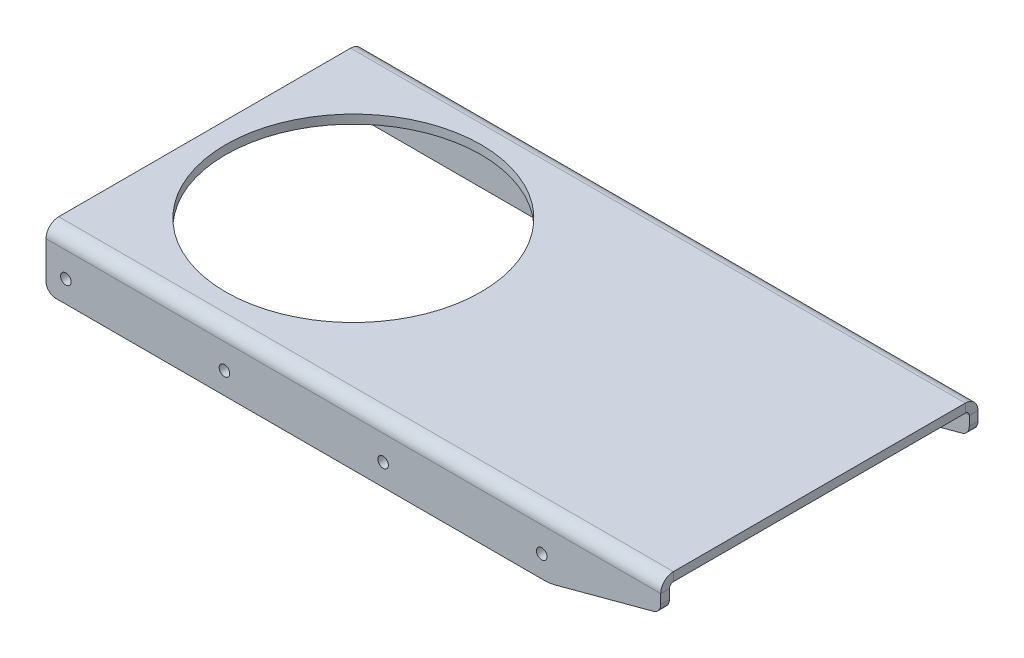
ISO-10303-21;
HEADER;
FILE_DESCRIPTION(('STEP AP214'),'2;1');
FILE_NAME('part.step','',(''),(''),'','','');
FILE_SCHEMA(('AUTOMOTIVE_DESIGN { 1 0 10303 214 1 1 1 1 }'));
ENDSEC;
DATA;
#1=APPLICATION_CONTEXT('core data for automotive mechanical design processes');
#2=APPLICATION_PROTOCOL_DEFINITION('international standard','automotive_design',2000,#1);
#3=PRODUCT_CONTEXT('',#1,'mechanical');
#4=PRODUCT('Part','Part','',(#3));
#5=PRODUCT_RELATED_PRODUCT_CATEGORY('part','',(#4));
#6=PRODUCT_DEFINITION_FORMATION('','',#4);
#7=PRODUCT_DEFINITION_CONTEXT('part definition',#1,'design');
#8=PRODUCT_DEFINITION('design','',#6,#7);
#9=PRODUCT_DEFINITION_SHAPE('','',#8);
#10=(LENGTH_UNIT() NAMED_UNIT(*) SI_UNIT(.MILLI.,.METRE.));
#11=(NAMED_UNIT(*) PLANE_ANGLE_UNIT() SI_UNIT($,.RADIAN.));
#12=(NAMED_UNIT(*) SI_UNIT($,.STERADIAN.) SOLID_ANGLE_UNIT());
#13=UNCERTAINTY_MEASURE_WITH_UNIT(LENGTH_MEASURE(1.E-05),#10,'distance_accuracy_value','');
#14=(GEOMETRIC_REPRESENTATION_CONTEXT(3) GLOBAL_UNCERTAINTY_ASSIGNED_CONTEXT((#13)) GLOBAL_UNIT_ASSIGNED_CONTEXT((#10,
#11,#12)) REPRESENTATION_CONTEXT('',''));
#15=CARTESIAN_POINT('',(0.,0.,0.));
#16=DIRECTION('',(0.,0.,1.));
#17=DIRECTION('',(1.,0.,0.));
#18=AXIS2_PLACEMENT_3D('',#15,#16,#17);
#19=CARTESIAN_POINT('',(0.,-5.588,0.));
#20=DIRECTION('',(0.,1.,0.));
#21=DIRECTION('',(0.,0.,1.));
#22=AXIS2_PLACEMENT_3D('',#19,#20,#21);
#23=PLANE('',#22);
#24=CARTESIAN_POINT('',(95.25,-5.588,0.));
#25=DIRECTION('',(0.,1.,0.));
#26=DIRECTION('',(0.,0.,1.));
#27=AXIS2_PLACEMENT_3D('',#24,#25,#26);
#28=CIRCLE('',#27,81.75625);
#29=CARTESIAN_POINT('',(95.25,-5.588,81.75625));
#30=VERTEX_POINT('',#29);
#31=EDGE_CURVE('E340',#30,#30,#28,.T.);
#32=ORIENTED_EDGE('',*,*,#31,.T.);
#33=EDGE_LOOP('',(#32));
#34=FACE_BOUND('',#33,.T.);
#35=DIRECTION('',(1.,0.,0.));
#36=VECTOR('',#35,1.);
#37=CARTESIAN_POINT('',(393.7,-5.58799999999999,-93.472));
#38=LINE('',#37,#36);
#39=CARTESIAN_POINT('',(393.7,-5.58799999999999,-93.472));
#40=VERTEX_POINT('',#39);
#41=CARTESIAN_POINT('',(0.,-5.58799999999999,-93.472));
#42=VERTEX_POINT('',#41);
#43=EDGE_CURVE('E283',#40,#42,#38,.F.);
#44=ORIENTED_EDGE('',*,*,#43,.F.);
#45=DIRECTION('',(0.,0.,-1.));
#46=VECTOR('',#45,1.);
#47=CARTESIAN_POINT('',(393.7,-5.588,-101.6));
#48=LINE('',#47,#46);
#49=CARTESIAN_POINT('',(393.7,-5.58799999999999,93.472));
#50=VERTEX_POINT('',#49);
#51=EDGE_CURVE('E349',#50,#40,#48,.T.);
#52=ORIENTED_EDGE('',*,*,#51,.F.);
#53=DIRECTION('',(-1.,0.,0.));
#54=VECTOR('',#53,1.);
#55=CARTESIAN_POINT('',(0.,-5.58799999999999,93.472));
#56=LINE('',#55,#54);
#57=CARTESIAN_POINT('',(0.,-5.58799999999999,93.472));
#58=VERTEX_POINT('',#57);
#59=EDGE_CURVE('E330',#58,#50,#56,.F.);
#60=ORIENTED_EDGE('',*,*,#59,.F.);
#61=DIRECTION('',(0.,0.,1.));
#62=VECTOR('',#61,1.);
#63=CARTESIAN_POINT('',(0.,-5.588,-101.6));
#64=LINE('',#63,#62);
#65=EDGE_CURVE('E346',#42,#58,#64,.T.);
#66=ORIENTED_EDGE('',*,*,#65,.F.);
#67=EDGE_LOOP('',(#44,#52,#60,#66));
#68=FACE_BOUND('',#67,.T.);
#69=ADVANCED_FACE('F89',(#34,#68),#23,.F.);
#70=CARTESIAN_POINT('',(0.,0.,0.));
#71=DIRECTION('',(0.,1.,0.));
#72=DIRECTION('',(0.,0.,1.));
#73=AXIS2_PLACEMENT_3D('',#70,#71,#72);
#74=PLANE('',#73);
#75=CARTESIAN_POINT('',(95.25,0.,0.));
#76=DIRECTION('',(0.,1.,0.));
#77=DIRECTION('',(0.,0.,1.));
#78=AXIS2_PLACEMENT_3D('',#75,#76,#77);
#79=CIRCLE('',#78,81.75625);
#80=CARTESIAN_POINT('',(95.25,0.,81.75625));
#81=VERTEX_POINT('',#80);
#82=EDGE_CURVE('E337',#81,#81,#79,.T.);
#83=ORIENTED_EDGE('',*,*,#82,.F.);
#84=EDGE_LOOP('',(#83));
#85=FACE_BOUND('',#84,.T.);
#86=DIRECTION('',(0.,0.,-1.));
#87=VECTOR('',#86,1.);
#88=CARTESIAN_POINT('',(393.7,0.,-101.6));
#89=LINE('',#88,#87);
#90=CARTESIAN_POINT('',(393.7,0.,93.472));
#91=VERTEX_POINT('',#90);
#92=CARTESIAN_POINT('',(393.7,0.,-93.472));
#93=VERTEX_POINT('',#92);
#94=EDGE_CURVE('E350',#91,#93,#89,.T.);
#95=ORIENTED_EDGE('',*,*,#94,.T.);
#96=DIRECTION('',(1.,0.,0.));
#97=VECTOR('',#96,1.);
#98=CARTESIAN_POINT('',(393.7,0.,-93.472));
#99=LINE('',#98,#97);
#100=CARTESIAN_POINT('',(0.,0.,-93.472));
#101=VERTEX_POINT('',#100);
#102=EDGE_CURVE('E232',#93,#101,#99,.F.);
#103=ORIENTED_EDGE('',*,*,#102,.T.);
#104=DIRECTION('',(0.,0.,1.));
#105=VECTOR('',#104,1.);
#106=CARTESIAN_POINT('',(0.,0.,-101.6));
#107=LINE('',#106,#105);
#108=CARTESIAN_POINT('',(0.,0.,93.472));
#109=VERTEX_POINT('',#108);
#110=EDGE_CURVE('E343',#101,#109,#107,.T.);
#111=ORIENTED_EDGE('',*,*,#110,.T.);
#112=DIRECTION('',(-1.,0.,0.));
#113=VECTOR('',#112,1.);
#114=CARTESIAN_POINT('',(0.,0.,93.472));
#115=LINE('',#114,#113);
#116=EDGE_CURVE('E317',#109,#91,#115,.F.);
#117=ORIENTED_EDGE('',*,*,#116,.T.);
#118=EDGE_LOOP('',(#95,#103,#111,#117));
#119=FACE_BOUND('',#118,.T.);
#120=ADVANCED_FACE('F454',(#85,#119),#74,.T.);
#121=CARTESIAN_POINT('',(393.7,-5.588,-101.6));
#122=DIRECTION('',(1.,0.,0.));
#123=DIRECTION('',(0.,0.,-1.));
#124=AXIS2_PLACEMENT_3D('',#121,#122,#123);
#125=PLANE('',#124);
#126=ORIENTED_EDGE('',*,*,#51,.T.);
#127=DIRECTION('',(0.,1.,0.));
#128=VECTOR('',#127,1.);
#129=CARTESIAN_POINT('',(393.7,-5.58799999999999,-93.472));
#130=LINE('',#129,#128);
#131=EDGE_CURVE('E279',#40,#93,#130,.T.);
#132=ORIENTED_EDGE('',*,*,#131,.T.);
#133=ORIENTED_EDGE('',*,*,#94,.F.);
#134=DIRECTION('',(0.,1.,0.));
#135=VECTOR('',#134,1.);
#136=CARTESIAN_POINT('',(393.7,-5.58799999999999,93.472));
#137=LINE('',#136,#135);
#138=EDGE_CURVE('E334',#50,#91,#137,.T.);
#139=ORIENTED_EDGE('',*,*,#138,.F.);
#140=EDGE_LOOP('',(#126,#132,#133,#139));
#141=FACE_BOUND('',#140,.T.);
#142=ADVANCED_FACE('F461',(#141),#125,.T.);
#143=CARTESIAN_POINT('',(0.,-5.588,-101.6));
#144=DIRECTION('',(-1.,0.,0.));
#145=DIRECTION('',(0.,0.,1.));
#146=AXIS2_PLACEMENT_3D('',#143,#144,#145);
#147=PLANE('',#146);
#148=DIRECTION('',(0.,1.,0.));
#149=VECTOR('',#148,1.);
#150=CARTESIAN_POINT('',(0.,-5.58799999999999,-93.472));
#151=LINE('',#150,#149);
#152=EDGE_CURVE('E286',#42,#101,#151,.T.);
#153=ORIENTED_EDGE('',*,*,#152,.F.);
#154=ORIENTED_EDGE('',*,*,#65,.T.);
#155=DIRECTION('',(0.,1.,0.));
#156=VECTOR('',#155,1.);
#157=CARTESIAN_POINT('',(0.,-5.58799999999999,93.472));
#158=LINE('',#157,#156);
#159=EDGE_CURVE('E324',#58,#109,#158,.T.);
#160=ORIENTED_EDGE('',*,*,#159,.T.);
#161=ORIENTED_EDGE('',*,*,#110,.F.);
#162=EDGE_LOOP('',(#153,#154,#160,#161));
#163=FACE_BOUND('',#162,.T.);
#164=ADVANCED_FACE('F471',(#163),#147,.T.);
#165=CARTESIAN_POINT('',(95.25,-5.588,0.));
#166=DIRECTION('',(0.,1.,0.));
#167=DIRECTION('',(0.,0.,1.));
#168=AXIS2_PLACEMENT_3D('',#165,#166,#167);
#169=CYLINDRICAL_SURFACE('',#168,81.75625);
#170=ORIENTED_EDGE('',*,*,#31,.F.);
#171=EDGE_LOOP('',(#170));
#172=FACE_BOUND('',#171,.T.);
#173=ORIENTED_EDGE('',*,*,#82,.T.);
#174=EDGE_LOOP('',(#173));
#175=FACE_BOUND('',#174,.T.);
#176=ADVANCED_FACE('F466',(#172,#175),#169,.F.);
#177=CARTESIAN_POINT('',(393.7,-8.12799999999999,93.472));
#178=DIRECTION('',(1.,0.,0.));
#179=DIRECTION('',(0.,0.,-1.));
#180=AXIS2_PLACEMENT_3D('',#177,#178,#179);
#181=PLANE('',#180);
#182=DIRECTION('',(0.,0.,-1.));
#183=VECTOR('',#182,1.);
#184=CARTESIAN_POINT('',(393.7,-8.12799999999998,101.6));
#185=LINE('',#184,#183);
#186=CARTESIAN_POINT('',(393.7,-8.12799999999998,96.012));
#187=VERTEX_POINT('',#186);
#188=CARTESIAN_POINT('',(393.7,-8.12799999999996,101.6));
#189=VERTEX_POINT('',#188);
#190=EDGE_CURVE('E289',#187,#189,#185,.F.);
#191=ORIENTED_EDGE('',*,*,#190,.F.);
#192=CARTESIAN_POINT('',(393.7,-8.12799999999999,93.472));
#193=DIRECTION('',(-1.,0.,0.));
#194=DIRECTION('',(0.,0.,1.));
#195=AXIS2_PLACEMENT_3D('',#192,#193,#194);
#196=CIRCLE('',#195,2.54);
#197=EDGE_CURVE('E327',#50,#187,#196,.F.);
#198=ORIENTED_EDGE('',*,*,#197,.F.);
#199=ORIENTED_EDGE('',*,*,#138,.T.);
#200=CARTESIAN_POINT('',(393.7,-8.12799999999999,93.472));
#201=DIRECTION('',(-1.,0.,0.));
#202=DIRECTION('',(0.,0.,1.));
#203=AXIS2_PLACEMENT_3D('',#200,#201,#202);
#204=CIRCLE('',#203,8.128);
#205=EDGE_CURVE('E320',#91,#189,#204,.F.);
#206=ORIENTED_EDGE('',*,*,#205,.T.);
#207=EDGE_LOOP('',(#191,#198,#199,#206));
#208=FACE_BOUND('',#207,.T.);
#209=ADVANCED_FACE('F792',(#208),#181,.T.);
#210=CARTESIAN_POINT('',(0.,-8.12799999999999,93.472));
#211=DIRECTION('',(1.,0.,0.));
#212=DIRECTION('',(0.,0.,-1.));
#213=AXIS2_PLACEMENT_3D('',#210,#211,#212);
#214=PLANE('',#213);
#215=CARTESIAN_POINT('',(0.,-8.12799999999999,93.472));
#216=DIRECTION('',(-1.,0.,0.));
#217=DIRECTION('',(0.,0.,1.));
#218=AXIS2_PLACEMENT_3D('',#215,#216,#217);
#219=CIRCLE('',#218,2.54);
#220=CARTESIAN_POINT('',(0.,-8.12799999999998,96.012));
#221=VERTEX_POINT('',#220);
#222=EDGE_CURVE('E293',#221,#58,#219,.T.);
#223=ORIENTED_EDGE('',*,*,#222,.F.);
#224=DIRECTION('',(0.,0.,-1.));
#225=VECTOR('',#224,1.);
#226=CARTESIAN_POINT('',(0.,-8.128,96.012));
#227=LINE('',#226,#225);
#228=CARTESIAN_POINT('',(0.,-8.128,101.6));
#229=VERTEX_POINT('',#228);
#230=EDGE_CURVE('E310',#221,#229,#227,.F.);
#231=ORIENTED_EDGE('',*,*,#230,.T.);
#232=CARTESIAN_POINT('',(0.,-8.12799999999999,93.472));
#233=DIRECTION('',(-1.,0.,0.));
#234=DIRECTION('',(0.,0.,1.));
#235=AXIS2_PLACEMENT_3D('',#232,#233,#234);
#236=CIRCLE('',#235,8.128);
#237=EDGE_CURVE('E321',#229,#109,#236,.T.);
#238=ORIENTED_EDGE('',*,*,#237,.T.);
#239=ORIENTED_EDGE('',*,*,#159,.F.);
#240=EDGE_LOOP('',(#223,#231,#238,#239));
#241=FACE_BOUND('',#240,.T.);
#242=ADVANCED_FACE('F781',(#241),#214,.F.);
#243=CARTESIAN_POINT('',(0.,-8.12799999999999,93.472));
#244=DIRECTION('',(-1.,0.,0.));
#245=DIRECTION('',(0.,0.,1.));
#246=AXIS2_PLACEMENT_3D('',#243,#244,#245);
#247=CYLINDRICAL_SURFACE('',#246,8.128);
#248=ORIENTED_EDGE('',*,*,#116,.F.);
#249=ORIENTED_EDGE('',*,*,#237,.F.);
#250=DIRECTION('',(-1.,0.,0.));
#251=VECTOR('',#250,1.);
#252=CARTESIAN_POINT('',(393.7,-8.12799999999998,101.6));
#253=LINE('',#252,#251);
#254=EDGE_CURVE('E307',#229,#189,#253,.F.);
#255=ORIENTED_EDGE('',*,*,#254,.T.);
#256=ORIENTED_EDGE('',*,*,#205,.F.);
#257=EDGE_LOOP('',(#248,#249,#255,#256));
#258=FACE_BOUND('',#257,.T.);
#259=ADVANCED_FACE('F770',(#258),#247,.T.);
#260=CARTESIAN_POINT('',(0.,-8.12799999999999,93.472));
#261=DIRECTION('',(-1.,0.,0.));
#262=DIRECTION('',(0.,0.,1.));
#263=AXIS2_PLACEMENT_3D('',#260,#261,#262);
#264=CYLINDRICAL_SURFACE('',#263,2.54);
#265=ORIENTED_EDGE('',*,*,#59,.T.);
#266=ORIENTED_EDGE('',*,*,#197,.T.);
#267=DIRECTION('',(-1.,0.,0.));
#268=VECTOR('',#267,1.);
#269=CARTESIAN_POINT('',(393.7,-8.12799999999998,96.012));
#270=LINE('',#269,#268);
#271=EDGE_CURVE('E313',#187,#221,#270,.T.);
#272=ORIENTED_EDGE('',*,*,#271,.T.);
#273=ORIENTED_EDGE('',*,*,#222,.T.);
#274=EDGE_LOOP('',(#265,#266,#272,#273));
#275=FACE_BOUND('',#274,.T.);
#276=ADVANCED_FACE('F759',(#275),#264,.F.);
#277=CARTESIAN_POINT('',(0.,-38.1,101.6));
#278=DIRECTION('',(1.,0.,0.));
#279=DIRECTION('',(0.,1.,0.));
#280=AXIS2_PLACEMENT_3D('',#277,#278,#279);
#281=PLANE('',#280);
#282=DIRECTION('',(0.,1.,0.));
#283=VECTOR('',#282,1.);
#284=CARTESIAN_POINT('',(0.,-38.1,96.0120000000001));
#285=LINE('',#284,#283);
#286=CARTESIAN_POINT('',(0.,-31.75,96.0120000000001));
#287=VERTEX_POINT('',#286);
#288=EDGE_CURVE('E304',#221,#287,#285,.F.);
#289=ORIENTED_EDGE('',*,*,#288,.T.);
#290=DIRECTION('',(0.,0.,-1.));
#291=VECTOR('',#290,1.);
#292=CARTESIAN_POINT('',(0.,-31.75,101.6));
#293=LINE('',#292,#291);
#294=CARTESIAN_POINT('',(0.,-31.75,101.6));
#295=VERTEX_POINT('',#294);
#296=EDGE_CURVE('E415',#287,#295,#293,.F.);
#297=ORIENTED_EDGE('',*,*,#296,.T.);
#298=DIRECTION('',(0.,-1.,0.));
#299=VECTOR('',#298,1.);
#300=CARTESIAN_POINT('',(0.,3.66455092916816E-13,101.6));
#301=LINE('',#300,#299);
#302=EDGE_CURVE('E296',#229,#295,#301,.T.);
#303=ORIENTED_EDGE('',*,*,#302,.F.);
#304=ORIENTED_EDGE('',*,*,#230,.F.);
#305=EDGE_LOOP('',(#289,#297,#303,#304));
#306=FACE_BOUND('',#305,.T.);
#307=ADVANCED_FACE('F748',(#306),#281,.F.);
#308=CARTESIAN_POINT('',(393.7,-5.58799999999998,101.6));
#309=DIRECTION('',(-1.,0.,0.));
#310=DIRECTION('',(0.,0.,1.));
#311=AXIS2_PLACEMENT_3D('',#308,#309,#310);
#312=PLANE('',#311);
#313=DIRECTION('',(0.,1.,0.));
#314=VECTOR('',#313,1.);
#315=CARTESIAN_POINT('',(393.7,3.66455092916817E-13,101.6));
#316=LINE('',#315,#314);
#317=CARTESIAN_POINT('',(393.7,-14.1774736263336,101.6));
#318=VERTEX_POINT('',#317);
#319=EDGE_CURVE('E291',#318,#189,#316,.T.);
#320=ORIENTED_EDGE('',*,*,#319,.F.);
#321=DIRECTION('',(0.,0.,1.));
#322=VECTOR('',#321,1.);
#323=CARTESIAN_POINT('',(393.7,-14.1774736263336,96.012));
#324=LINE('',#323,#322);
#325=CARTESIAN_POINT('',(393.7,-14.1774736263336,96.012));
#326=VERTEX_POINT('',#325);
#327=EDGE_CURVE('E392',#318,#326,#324,.F.);
#328=ORIENTED_EDGE('',*,*,#327,.T.);
#329=DIRECTION('',(0.,-1.,0.));
#330=VECTOR('',#329,1.);
#331=CARTESIAN_POINT('',(393.7,-5.588,96.012));
#332=LINE('',#331,#330);
#333=EDGE_CURVE('E299',#326,#187,#332,.F.);
#334=ORIENTED_EDGE('',*,*,#333,.T.);
#335=ORIENTED_EDGE('',*,*,#190,.T.);
#336=EDGE_LOOP('',(#320,#328,#334,#335));
#337=FACE_BOUND('',#336,.T.);
#338=ADVANCED_FACE('F515',(#337),#312,.F.);
#339=CARTESIAN_POINT('',(0.,3.66455092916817E-13,101.6));
#340=DIRECTION('',(0.,0.,-1.));
#341=DIRECTION('',(0.,1.,0.));
#342=AXIS2_PLACEMENT_3D('',#339,#340,#341);
#343=PLANE('',#342);
#344=CARTESIAN_POINT('',(12.7,-24.13,101.6));
#345=DIRECTION('',(0.,0.,1.));
#346=DIRECTION('',(1.,0.,0.));
#347=AXIS2_PLACEMENT_3D('',#344,#345,#346);
#348=CIRCLE('',#347,3.3782);
#349=CARTESIAN_POINT('',(16.0782,-24.13,101.6));
#350=VERTEX_POINT('',#349);
#351=EDGE_CURVE('E902',#350,#350,#348,.T.);
#352=ORIENTED_EDGE('',*,*,#351,.F.);
#353=EDGE_LOOP('',(#352));
#354=FACE_BOUND('',#353,.T.);
#355=CARTESIAN_POINT('',(114.3,-24.13,101.6));
#356=DIRECTION('',(0.,0.,1.));
#357=DIRECTION('',(1.,0.,0.));
#358=AXIS2_PLACEMENT_3D('',#355,#356,#357);
#359=CIRCLE('',#358,3.3782);
#360=CARTESIAN_POINT('',(117.6782,-24.13,101.6));
#361=VERTEX_POINT('',#360);
#362=EDGE_CURVE('E890',#361,#361,#359,.T.);
#363=ORIENTED_EDGE('',*,*,#362,.F.);
#364=EDGE_LOOP('',(#363));
#365=FACE_BOUND('',#364,.T.);
#366=CARTESIAN_POINT('',(215.9,-24.13,101.6));
#367=DIRECTION('',(0.,0.,1.));
#368=DIRECTION('',(1.,0.,0.));
#369=AXIS2_PLACEMENT_3D('',#366,#367,#368);
#370=CIRCLE('',#369,3.3782);
#371=CARTESIAN_POINT('',(219.2782,-24.13,101.6));
#372=VERTEX_POINT('',#371);
#373=EDGE_CURVE('E883',#372,#372,#370,.T.);
#374=ORIENTED_EDGE('',*,*,#373,.F.);
#375=EDGE_LOOP('',(#374));
#376=FACE_BOUND('',#375,.T.);
#377=CARTESIAN_POINT('',(317.5,-24.13,101.6));
#378=DIRECTION('',(0.,0.,1.));
#379=DIRECTION('',(1.,0.,0.));
#380=AXIS2_PLACEMENT_3D('',#377,#378,#379);
#381=CIRCLE('',#380,3.3782);
#382=CARTESIAN_POINT('',(320.8782,-24.13,101.6));
#383=VERTEX_POINT('',#382);
#384=EDGE_CURVE('E876',#383,#383,#381,.T.);
#385=ORIENTED_EDGE('',*,*,#384,.F.);
#386=EDGE_LOOP('',(#385));
#387=FACE_BOUND('',#386,.T.);
#388=DIRECTION('',(1.,0.,0.));
#389=VECTOR('',#388,1.);
#390=CARTESIAN_POINT('',(0.,-38.1,101.6));
#391=LINE('',#390,#389);
#392=CARTESIAN_POINT('',(6.34999999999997,-38.1,101.6));
#393=VERTEX_POINT('',#392);
#394=CARTESIAN_POINT('',(319.260458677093,-38.1,101.6));
#395=VERTEX_POINT('',#394);
#396=EDGE_CURVE('E294',#393,#395,#391,.T.);
#397=ORIENTED_EDGE('',*,*,#396,.T.);
#398=CARTESIAN_POINT('',(319.260458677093,-12.7,101.6));
#399=DIRECTION('',(0.,0.,-1.));
#400=DIRECTION('',(0.,1.,0.));
#401=AXIS2_PLACEMENT_3D('',#398,#399,#400);
#402=CIRCLE('',#401,25.4);
#403=CARTESIAN_POINT('',(325.834462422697,-37.2345159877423,101.6));
#404=VERTEX_POINT('',#403);
#405=EDGE_CURVE('E111',#395,#404,#402,.F.);
#406=ORIENTED_EDGE('',*,*,#405,.T.);
#407=DIRECTION('',(-0.965925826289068,-0.258819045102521,0.));
#408=VECTOR('',#407,1.);
#409=CARTESIAN_POINT('',(393.7,-19.05,101.6));
#410=LINE('',#409,#408);
#411=CARTESIAN_POINT('',(388.993500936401,-20.3111026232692,101.6));
#412=VERTEX_POINT('',#411);
#413=EDGE_CURVE('E373',#404,#412,#410,.F.);
#414=ORIENTED_EDGE('',*,*,#413,.T.);
#415=CARTESIAN_POINT('',(387.35,-14.1774736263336,101.6));
#416=DIRECTION('',(0.,0.,-1.));
#417=DIRECTION('',(0.,1.,0.));
#418=AXIS2_PLACEMENT_3D('',#415,#416,#417);
#419=CIRCLE('',#418,6.35);
#420=EDGE_CURVE('E404',#412,#318,#419,.F.);
#421=ORIENTED_EDGE('',*,*,#420,.T.);
#422=ORIENTED_EDGE('',*,*,#319,.T.);
#423=ORIENTED_EDGE('',*,*,#254,.F.);
#424=ORIENTED_EDGE('',*,*,#302,.T.);
#425=CARTESIAN_POINT('',(6.34999999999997,-31.75,101.6));
#426=DIRECTION('',(0.,0.,-1.));
#427=DIRECTION('',(0.,1.,0.));
#428=AXIS2_PLACEMENT_3D('',#425,#426,#427);
#429=CIRCLE('',#428,6.35);
#430=EDGE_CURVE('E402',#295,#393,#429,.F.);
#431=ORIENTED_EDGE('',*,*,#430,.T.);
#432=EDGE_LOOP('',(#397,#406,#414,#421,#422,#423,#424,#431));
#433=FACE_BOUND('',#432,.T.);
#434=ADVANCED_FACE('F437',(#354,#365,#376,#387,#433),#343,.F.);
#435=CARTESIAN_POINT('',(0.,3.46944695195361E-13,96.012));
#436=DIRECTION('',(0.,0.,-1.));
#437=DIRECTION('',(0.,1.,0.));
#438=AXIS2_PLACEMENT_3D('',#435,#436,#437);
#439=PLANE('',#438);
#440=CARTESIAN_POINT('',(12.7,-24.13,96.0120000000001));
#441=DIRECTION('',(0.,0.,-1.));
#442=DIRECTION('',(0.,1.,0.));
#443=AXIS2_PLACEMENT_3D('',#440,#441,#442);
#444=CIRCLE('',#443,3.37819999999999);
#445=CARTESIAN_POINT('',(12.7,-20.7518,96.0120000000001));
#446=VERTEX_POINT('',#445);
#447=EDGE_CURVE('E896',#446,#446,#444,.T.);
#448=ORIENTED_EDGE('',*,*,#447,.F.);
#449=EDGE_LOOP('',(#448));
#450=FACE_BOUND('',#449,.T.);
#451=CARTESIAN_POINT('',(114.3,-24.13,96.0120000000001));
#452=DIRECTION('',(0.,0.,-1.));
#453=DIRECTION('',(0.,1.,0.));
#454=AXIS2_PLACEMENT_3D('',#451,#452,#453);
#455=CIRCLE('',#454,3.37819999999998);
#456=CARTESIAN_POINT('',(114.3,-20.7518,96.0120000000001));
#457=VERTEX_POINT('',#456);
#458=EDGE_CURVE('E370',#457,#457,#455,.T.);
#459=ORIENTED_EDGE('',*,*,#458,.F.);
#460=EDGE_LOOP('',(#459));
#461=FACE_BOUND('',#460,.T.);
#462=CARTESIAN_POINT('',(215.9,-24.13,96.0120000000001));
#463=DIRECTION('',(0.,0.,-1.));
#464=DIRECTION('',(0.,1.,0.));
#465=AXIS2_PLACEMENT_3D('',#462,#463,#464);
#466=CIRCLE('',#465,3.37819999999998);
#467=CARTESIAN_POINT('',(215.9,-20.7518,96.0120000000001));
#468=VERTEX_POINT('',#467);
#469=EDGE_CURVE('E365',#468,#468,#466,.T.);
#470=ORIENTED_EDGE('',*,*,#469,.F.);
#471=EDGE_LOOP('',(#470));
#472=FACE_BOUND('',#471,.T.);
#473=CARTESIAN_POINT('',(317.5,-24.13,96.0120000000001));
#474=DIRECTION('',(0.,0.,-1.));
#475=DIRECTION('',(0.,1.,0.));
#476=AXIS2_PLACEMENT_3D('',#473,#474,#475);
#477=CIRCLE('',#476,3.3782);
#478=CARTESIAN_POINT('',(317.5,-20.7518,96.0120000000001));
#479=VERTEX_POINT('',#478);
#480=EDGE_CURVE('E276',#479,#479,#477,.T.);
#481=ORIENTED_EDGE('',*,*,#480,.F.);
#482=EDGE_LOOP('',(#481));
#483=FACE_BOUND('',#482,.T.);
#484=DIRECTION('',(0.965925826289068,0.258819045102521,0.));
#485=VECTOR('',#484,1.);
#486=CARTESIAN_POINT('',(31.1353992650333,-116.198891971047,96.0120000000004));
#487=LINE('',#486,#485);
#488=CARTESIAN_POINT('',(388.993500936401,-20.3111026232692,96.0120000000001));
#489=VERTEX_POINT('',#488);
#490=CARTESIAN_POINT('',(325.834462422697,-37.2345159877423,96.0120000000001));
#491=VERTEX_POINT('',#490);
#492=EDGE_CURVE('E353',#489,#491,#487,.F.);
#493=ORIENTED_EDGE('',*,*,#492,.T.);
#494=CARTESIAN_POINT('',(319.260458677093,-12.7,96.012));
#495=DIRECTION('',(0.,0.,-1.));
#496=DIRECTION('',(0.,1.,0.));
#497=AXIS2_PLACEMENT_3D('',#494,#495,#496);
#498=CIRCLE('',#497,25.4);
#499=CARTESIAN_POINT('',(319.260458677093,-38.1,96.0120000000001));
#500=VERTEX_POINT('',#499);
#501=EDGE_CURVE('E13',#491,#500,#498,.T.);
#502=ORIENTED_EDGE('',*,*,#501,.T.);
#503=DIRECTION('',(-1.,0.,0.));
#504=VECTOR('',#503,1.);
#505=CARTESIAN_POINT('',(393.7,-38.1,96.0120000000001));
#506=LINE('',#505,#504);
#507=CARTESIAN_POINT('',(6.34999999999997,-38.1,96.0120000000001));
#508=VERTEX_POINT('',#507);
#509=EDGE_CURVE('E301',#508,#500,#506,.F.);
#510=ORIENTED_EDGE('',*,*,#509,.F.);
#511=CARTESIAN_POINT('',(6.34999999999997,-31.75,96.0120000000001));
#512=DIRECTION('',(0.,0.,-1.));
#513=DIRECTION('',(0.,1.,0.));
#514=AXIS2_PLACEMENT_3D('',#511,#512,#513);
#515=CIRCLE('',#514,6.35);
#516=EDGE_CURVE('E395',#508,#287,#515,.T.);
#517=ORIENTED_EDGE('',*,*,#516,.T.);
#518=ORIENTED_EDGE('',*,*,#288,.F.);
#519=ORIENTED_EDGE('',*,*,#271,.F.);
#520=ORIENTED_EDGE('',*,*,#333,.F.);
#521=CARTESIAN_POINT('',(387.35,-14.1774736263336,96.012));
#522=DIRECTION('',(0.,0.,-1.));
#523=DIRECTION('',(0.,1.,0.));
#524=AXIS2_PLACEMENT_3D('',#521,#522,#523);
#525=CIRCLE('',#524,6.35);
#526=EDGE_CURVE('E397',#326,#489,#525,.T.);
#527=ORIENTED_EDGE('',*,*,#526,.T.);
#528=EDGE_LOOP('',(#493,#502,#510,#517,#518,#519,#520,#527));
#529=FACE_BOUND('',#528,.T.);
#530=ADVANCED_FACE('F445',(#450,#461,#472,#483,#529),#439,.T.);
#531=CARTESIAN_POINT('',(393.7,-38.1,101.6));
#532=DIRECTION('',(0.,1.,0.));
#533=DIRECTION('',(0.,0.,1.));
#534=AXIS2_PLACEMENT_3D('',#531,#532,#533);
#535=PLANE('',#534);
#536=ORIENTED_EDGE('',*,*,#509,.T.);
#537=DIRECTION('',(0.,0.,-1.));
#538=VECTOR('',#537,1.);
#539=CARTESIAN_POINT('',(319.260458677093,-38.1,101.6));
#540=LINE('',#539,#538);
#541=EDGE_CURVE('E426',#500,#395,#540,.F.);
#542=ORIENTED_EDGE('',*,*,#541,.T.);
#543=ORIENTED_EDGE('',*,*,#396,.F.);
#544=DIRECTION('',(0.,0.,-1.));
#545=VECTOR('',#544,1.);
#546=CARTESIAN_POINT('',(6.34999999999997,-38.1,101.6));
#547=LINE('',#546,#545);
#548=EDGE_CURVE('E412',#393,#508,#547,.T.);
#549=ORIENTED_EDGE('',*,*,#548,.T.);
#550=EDGE_LOOP('',(#536,#542,#543,#549));
#551=FACE_BOUND('',#550,.T.);
#552=ADVANCED_FACE('F432',(#551),#535,.F.);
#553=CARTESIAN_POINT('',(0.,-8.12799999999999,-93.472));
#554=DIRECTION('',(-1.,0.,0.));
#555=DIRECTION('',(0.,0.,1.));
#556=AXIS2_PLACEMENT_3D('',#553,#554,#555);
#557=PLANE('',#556);
#558=DIRECTION('',(0.,0.,1.));
#559=VECTOR('',#558,1.);
#560=CARTESIAN_POINT('',(0.,-8.12799999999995,-101.6));
#561=LINE('',#560,#559);
#562=CARTESIAN_POINT('',(0.,-8.12799999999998,-96.012));
#563=VERTEX_POINT('',#562);
#564=CARTESIAN_POINT('',(0.,-8.12799999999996,-101.6));
#565=VERTEX_POINT('',#564);
#566=EDGE_CURVE('E273',#563,#565,#561,.F.);
#567=ORIENTED_EDGE('',*,*,#566,.F.);
#568=CARTESIAN_POINT('',(0.,-8.12799999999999,-93.472));
#569=DIRECTION('',(1.,0.,0.));
#570=DIRECTION('',(0.,0.,-1.));
#571=AXIS2_PLACEMENT_3D('',#568,#569,#570);
#572=CIRCLE('',#571,2.54);
#573=EDGE_CURVE('E235',#42,#563,#572,.F.);
#574=ORIENTED_EDGE('',*,*,#573,.F.);
#575=ORIENTED_EDGE('',*,*,#152,.T.);
#576=CARTESIAN_POINT('',(0.,-8.12799999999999,-93.472));
#577=DIRECTION('',(1.,0.,0.));
#578=DIRECTION('',(0.,0.,-1.));
#579=AXIS2_PLACEMENT_3D('',#576,#577,#578);
#580=CIRCLE('',#579,8.128);
#581=EDGE_CURVE('E278',#101,#565,#580,.F.);
#582=ORIENTED_EDGE('',*,*,#581,.T.);
#583=EDGE_LOOP('',(#567,#574,#575,#582));
#584=FACE_BOUND('',#583,.T.);
#585=ADVANCED_FACE('F533',(#584),#557,.T.);
#586=CARTESIAN_POINT('',(393.7,-8.12799999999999,-93.472));
#587=DIRECTION('',(-1.,0.,0.));
#588=DIRECTION('',(0.,0.,1.));
#589=AXIS2_PLACEMENT_3D('',#586,#587,#588);
#590=PLANE('',#589);
#591=CARTESIAN_POINT('',(393.7,-8.12799999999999,-93.472));
#592=DIRECTION('',(1.,0.,0.));
#593=DIRECTION('',(0.,0.,-1.));
#594=AXIS2_PLACEMENT_3D('',#591,#592,#593);
#595=CIRCLE('',#594,2.54);
#596=CARTESIAN_POINT('',(393.7,-8.12799999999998,-96.012));
#597=VERTEX_POINT('',#596);
#598=EDGE_CURVE('E242',#597,#40,#595,.T.);
#599=ORIENTED_EDGE('',*,*,#598,.F.);
#600=DIRECTION('',(0.,0.,1.));
#601=VECTOR('',#600,1.);
#602=CARTESIAN_POINT('',(393.7,-8.12799999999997,-96.012));
#603=LINE('',#602,#601);
#604=CARTESIAN_POINT('',(393.7,-8.12799999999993,-101.6));
#605=VERTEX_POINT('',#604);
#606=EDGE_CURVE('E239',#597,#605,#603,.F.);
#607=ORIENTED_EDGE('',*,*,#606,.T.);
#608=CARTESIAN_POINT('',(393.7,-8.12799999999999,-93.472));
#609=DIRECTION('',(1.,0.,0.));
#610=DIRECTION('',(0.,0.,-1.));
#611=AXIS2_PLACEMENT_3D('',#608,#609,#610);
#612=CIRCLE('',#611,8.128);
#613=EDGE_CURVE('E225',#605,#93,#612,.T.);
#614=ORIENTED_EDGE('',*,*,#613,.T.);
#615=ORIENTED_EDGE('',*,*,#131,.F.);
#616=EDGE_LOOP('',(#599,#607,#614,#615));
#617=FACE_BOUND('',#616,.T.);
#618=ADVANCED_FACE('F240',(#617),#590,.F.);
#619=CARTESIAN_POINT('',(393.7,-8.12799999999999,-93.472));
#620=DIRECTION('',(1.,0.,0.));
#621=DIRECTION('',(0.,0.,-1.));
#622=AXIS2_PLACEMENT_3D('',#619,#620,#621);
#623=CYLINDRICAL_SURFACE('',#622,8.128);
#624=ORIENTED_EDGE('',*,*,#102,.F.);
#625=ORIENTED_EDGE('',*,*,#613,.F.);
#626=DIRECTION('',(1.,0.,0.));
#627=VECTOR('',#626,1.);
#628=CARTESIAN_POINT('',(0.,-8.12799999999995,-101.6));
#629=LINE('',#628,#627);
#630=EDGE_CURVE('E229',#605,#565,#629,.F.);
#631=ORIENTED_EDGE('',*,*,#630,.T.);
#632=ORIENTED_EDGE('',*,*,#581,.F.);
#633=EDGE_LOOP('',(#624,#625,#631,#632));
#634=FACE_BOUND('',#633,.T.);
#635=ADVANCED_FACE('F227',(#634),#623,.T.);
#636=CARTESIAN_POINT('',(393.7,-8.12799999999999,-93.472));
#637=DIRECTION('',(1.,0.,0.));
#638=DIRECTION('',(0.,0.,-1.));
#639=AXIS2_PLACEMENT_3D('',#636,#637,#638);
#640=CYLINDRICAL_SURFACE('',#639,2.54);
#641=ORIENTED_EDGE('',*,*,#43,.T.);
#642=ORIENTED_EDGE('',*,*,#573,.T.);
#643=DIRECTION('',(1.,0.,0.));
#644=VECTOR('',#643,1.);
#645=CARTESIAN_POINT('',(0.,-8.12799999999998,-96.012));
#646=LINE('',#645,#644);
#647=EDGE_CURVE('E247',#563,#597,#646,.T.);
#648=ORIENTED_EDGE('',*,*,#647,.T.);
#649=ORIENTED_EDGE('',*,*,#598,.T.);
#650=EDGE_LOOP('',(#641,#642,#648,#649));
#651=FACE_BOUND('',#650,.T.);
#652=ADVANCED_FACE('F693',(#651),#640,.F.);
#653=CARTESIAN_POINT('',(393.7,-38.1,-101.6));
#654=DIRECTION('',(-1.,0.,0.));
#655=DIRECTION('',(0.,0.,1.));
#656=AXIS2_PLACEMENT_3D('',#653,#654,#655);
#657=PLANE('',#656);
#658=DIRECTION('',(0.,1.,0.));
#659=VECTOR('',#658,1.);
#660=CARTESIAN_POINT('',(393.7,-38.1,-96.0120000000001));
#661=LINE('',#660,#659);
#662=CARTESIAN_POINT('',(393.7,-14.1774736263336,-96.012));
#663=VERTEX_POINT('',#662);
#664=EDGE_CURVE('E256',#597,#663,#661,.F.);
#665=ORIENTED_EDGE('',*,*,#664,.T.);
#666=DIRECTION('',(0.,0.,1.));
#667=VECTOR('',#666,1.);
#668=CARTESIAN_POINT('',(393.7,-14.1774736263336,-101.6));
#669=LINE('',#668,#667);
#670=CARTESIAN_POINT('',(393.7,-14.1774736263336,-101.6));
#671=VERTEX_POINT('',#670);
#672=EDGE_CURVE('E261',#663,#671,#669,.F.);
#673=ORIENTED_EDGE('',*,*,#672,.T.);
#674=DIRECTION('',(0.,-1.,0.));
#675=VECTOR('',#674,1.);
#676=CARTESIAN_POINT('',(393.7,3.66455092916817E-13,-101.6));
#677=LINE('',#676,#675);
#678=EDGE_CURVE('E253',#605,#671,#677,.T.);
#679=ORIENTED_EDGE('',*,*,#678,.F.);
#680=ORIENTED_EDGE('',*,*,#606,.F.);
#681=EDGE_LOOP('',(#665,#673,#679,#680));
#682=FACE_BOUND('',#681,.T.);
#683=ADVANCED_FACE('F259',(#682),#657,.F.);
#684=CARTESIAN_POINT('',(0.,-5.58799999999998,-101.6));
#685=DIRECTION('',(1.,0.,0.));
#686=DIRECTION('',(0.,0.,-1.));
#687=AXIS2_PLACEMENT_3D('',#684,#685,#686);
#688=PLANE('',#687);
#689=DIRECTION('',(0.,1.,0.));
#690=VECTOR('',#689,1.);
#691=CARTESIAN_POINT('',(0.,3.66455092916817E-13,-101.6));
#692=LINE('',#691,#690);
#693=CARTESIAN_POINT('',(0.,-31.75,-101.6));
#694=VERTEX_POINT('',#693);
#695=EDGE_CURVE('E255',#694,#565,#692,.T.);
#696=ORIENTED_EDGE('',*,*,#695,.F.);
#697=DIRECTION('',(0.,0.,1.));
#698=VECTOR('',#697,1.);
#699=CARTESIAN_POINT('',(0.,-31.75,-101.6));
#700=LINE('',#699,#698);
#701=CARTESIAN_POINT('',(0.,-31.75,-96.0120000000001));
#702=VERTEX_POINT('',#701);
#703=EDGE_CURVE('E406',#694,#702,#700,.T.);
#704=ORIENTED_EDGE('',*,*,#703,.T.);
#705=DIRECTION('',(0.,-1.,0.));
#706=VECTOR('',#705,1.);
#707=CARTESIAN_POINT('',(0.,-5.588,-96.012));
#708=LINE('',#707,#706);
#709=EDGE_CURVE('E263',#702,#563,#708,.F.);
#710=ORIENTED_EDGE('',*,*,#709,.T.);
#711=ORIENTED_EDGE('',*,*,#566,.T.);
#712=EDGE_LOOP('',(#696,#704,#710,#711));
#713=FACE_BOUND('',#712,.T.);
#714=ADVANCED_FACE('F543',(#713),#688,.F.);
#715=CARTESIAN_POINT('',(0.,3.66455092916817E-13,-101.6));
#716=DIRECTION('',(0.,0.,1.));
#717=DIRECTION('',(0.,-1.,0.));
#718=AXIS2_PLACEMENT_3D('',#715,#716,#717);
#719=PLANE('',#718);
#720=CARTESIAN_POINT('',(12.7,-24.13,-101.6));
#721=DIRECTION('',(0.,0.,1.));
#722=DIRECTION('',(1.,0.,0.));
#723=AXIS2_PLACEMENT_3D('',#720,#721,#722);
#724=CIRCLE('',#723,3.37819999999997);
#725=CARTESIAN_POINT('',(16.0782,-24.13,-101.6));
#726=VERTEX_POINT('',#725);
#727=EDGE_CURVE('E899',#726,#726,#724,.T.);
#728=ORIENTED_EDGE('',*,*,#727,.T.);
#729=EDGE_LOOP('',(#728));
#730=FACE_BOUND('',#729,.T.);
#731=CARTESIAN_POINT('',(114.3,-24.13,-101.6));
#732=DIRECTION('',(0.,0.,1.));
#733=DIRECTION('',(1.,0.,0.));
#734=AXIS2_PLACEMENT_3D('',#731,#732,#733);
#735=CIRCLE('',#734,3.37819999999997);
#736=CARTESIAN_POINT('',(117.6782,-24.13,-101.6));
#737=VERTEX_POINT('',#736);
#738=EDGE_CURVE('E371',#737,#737,#735,.T.);
#739=ORIENTED_EDGE('',*,*,#738,.T.);
#740=EDGE_LOOP('',(#739));
#741=FACE_BOUND('',#740,.T.);
#742=CARTESIAN_POINT('',(215.9,-24.13,-101.6));
#743=DIRECTION('',(0.,0.,1.));
#744=DIRECTION('',(1.,0.,0.));
#745=AXIS2_PLACEMENT_3D('',#742,#743,#744);
#746=CIRCLE('',#745,3.37819999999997);
#747=CARTESIAN_POINT('',(219.2782,-24.13,-101.6));
#748=VERTEX_POINT('',#747);
#749=EDGE_CURVE('E366',#748,#748,#746,.T.);
#750=ORIENTED_EDGE('',*,*,#749,.T.);
#751=EDGE_LOOP('',(#750));
#752=FACE_BOUND('',#751,.T.);
#753=CARTESIAN_POINT('',(317.5,-24.13,-101.6));
#754=DIRECTION('',(0.,0.,1.));
#755=DIRECTION('',(1.,0.,0.));
#756=AXIS2_PLACEMENT_3D('',#753,#754,#755);
#757=CIRCLE('',#756,3.3782);
#758=CARTESIAN_POINT('',(320.8782,-24.13,-101.6));
#759=VERTEX_POINT('',#758);
#760=EDGE_CURVE('E361',#759,#759,#757,.T.);
#761=ORIENTED_EDGE('',*,*,#760,.T.);
#762=EDGE_LOOP('',(#761));
#763=FACE_BOUND('',#762,.T.);
#764=DIRECTION('',(0.965925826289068,0.258819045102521,0.));
#765=VECTOR('',#764,1.);
#766=CARTESIAN_POINT('',(322.604432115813,-38.1,-101.6));
#767=LINE('',#766,#765);
#768=CARTESIAN_POINT('',(388.993500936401,-20.3111026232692,-101.6));
#769=VERTEX_POINT('',#768);
#770=CARTESIAN_POINT('',(325.834462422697,-37.2345159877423,-101.6));
#771=VERTEX_POINT('',#770);
#772=EDGE_CURVE('E377',#769,#771,#767,.F.);
#773=ORIENTED_EDGE('',*,*,#772,.T.);
#774=CARTESIAN_POINT('',(319.260458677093,-12.7,-101.6));
#775=DIRECTION('',(0.,0.,1.));
#776=DIRECTION('',(0.,-1.,0.));
#777=AXIS2_PLACEMENT_3D('',#774,#775,#776);
#778=CIRCLE('',#777,25.4);
#779=CARTESIAN_POINT('',(319.260458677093,-38.1,-101.6));
#780=VERTEX_POINT('',#779);
#781=EDGE_CURVE('E424',#771,#780,#778,.F.);
#782=ORIENTED_EDGE('',*,*,#781,.T.);
#783=DIRECTION('',(-1.,0.,0.));
#784=VECTOR('',#783,1.);
#785=CARTESIAN_POINT('',(0.,-38.1,-101.6));
#786=LINE('',#785,#784);
#787=CARTESIAN_POINT('',(6.34999999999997,-38.1,-101.6));
#788=VERTEX_POINT('',#787);
#789=EDGE_CURVE('E262',#780,#788,#786,.T.);
#790=ORIENTED_EDGE('',*,*,#789,.T.);
#791=CARTESIAN_POINT('',(6.34999999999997,-31.75,-101.6));
#792=DIRECTION('',(0.,0.,1.));
#793=DIRECTION('',(0.,-1.,0.));
#794=AXIS2_PLACEMENT_3D('',#791,#792,#793);
#795=CIRCLE('',#794,6.35);
#796=EDGE_CURVE('E380',#788,#694,#795,.F.);
#797=ORIENTED_EDGE('',*,*,#796,.T.);
#798=ORIENTED_EDGE('',*,*,#695,.T.);
#799=ORIENTED_EDGE('',*,*,#630,.F.);
#800=ORIENTED_EDGE('',*,*,#678,.T.);
#801=CARTESIAN_POINT('',(387.35,-14.1774736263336,-101.6));
#802=DIRECTION('',(0.,0.,1.));
#803=DIRECTION('',(0.,-1.,0.));
#804=AXIS2_PLACEMENT_3D('',#801,#802,#803);
#805=CIRCLE('',#804,6.35);
#806=EDGE_CURVE('E382',#671,#769,#805,.F.);
#807=ORIENTED_EDGE('',*,*,#806,.T.);
#808=EDGE_LOOP('',(#773,#782,#790,#797,#798,#799,#800,#807));
#809=FACE_BOUND('',#808,.T.);
#810=ADVANCED_FACE('F252',(#730,#741,#752,#763,#809),#719,.F.);
#811=CARTESIAN_POINT('',(0.,3.46944695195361E-13,-96.012));
#812=DIRECTION('',(0.,0.,1.));
#813=DIRECTION('',(0.,-1.,0.));
#814=AXIS2_PLACEMENT_3D('',#811,#812,#813);
#815=PLANE('',#814);
#816=CARTESIAN_POINT('',(12.7,-24.13,-96.0120000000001));
#817=DIRECTION('',(0.,0.,1.));
#818=DIRECTION('',(0.,-1.,0.));
#819=AXIS2_PLACEMENT_3D('',#816,#817,#818);
#820=CIRCLE('',#819,3.37819999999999);
#821=CARTESIAN_POINT('',(12.7,-27.5082,-96.0120000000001));
#822=VERTEX_POINT('',#821);
#823=EDGE_CURVE('E893',#822,#822,#820,.T.);
#824=ORIENTED_EDGE('',*,*,#823,.F.);
#825=EDGE_LOOP('',(#824));
#826=FACE_BOUND('',#825,.T.);
#827=CARTESIAN_POINT('',(114.3,-24.13,-96.0120000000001));
#828=DIRECTION('',(0.,0.,1.));
#829=DIRECTION('',(0.,-1.,0.));
#830=AXIS2_PLACEMENT_3D('',#827,#828,#829);
#831=CIRCLE('',#830,3.37819999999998);
#832=CARTESIAN_POINT('',(114.3,-27.5082,-96.0120000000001));
#833=VERTEX_POINT('',#832);
#834=EDGE_CURVE('E367',#833,#833,#831,.T.);
#835=ORIENTED_EDGE('',*,*,#834,.F.);
#836=EDGE_LOOP('',(#835));
#837=FACE_BOUND('',#836,.T.);
#838=CARTESIAN_POINT('',(215.9,-24.13,-96.0120000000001));
#839=DIRECTION('',(0.,0.,1.));
#840=DIRECTION('',(0.,-1.,0.));
#841=AXIS2_PLACEMENT_3D('',#838,#839,#840);
#842=CIRCLE('',#841,3.37819999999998);
#843=CARTESIAN_POINT('',(215.9,-27.5082,-96.0120000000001));
#844=VERTEX_POINT('',#843);
#845=EDGE_CURVE('E362',#844,#844,#842,.T.);
#846=ORIENTED_EDGE('',*,*,#845,.F.);
#847=EDGE_LOOP('',(#846));
#848=FACE_BOUND('',#847,.T.);
#849=CARTESIAN_POINT('',(317.5,-24.13,-96.0120000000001));
#850=DIRECTION('',(0.,0.,1.));
#851=DIRECTION('',(0.,-1.,0.));
#852=AXIS2_PLACEMENT_3D('',#849,#850,#851);
#853=CIRCLE('',#852,3.3782);
#854=CARTESIAN_POINT('',(317.5,-27.5082,-96.0120000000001));
#855=VERTEX_POINT('',#854);
#856=EDGE_CURVE('E358',#855,#855,#853,.T.);
#857=ORIENTED_EDGE('',*,*,#856,.F.);
#858=EDGE_LOOP('',(#857));
#859=FACE_BOUND('',#858,.T.);
#860=DIRECTION('',(1.,0.,0.));
#861=VECTOR('',#860,1.);
#862=CARTESIAN_POINT('',(0.,-38.1,-96.0120000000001));
#863=LINE('',#862,#861);
#864=CARTESIAN_POINT('',(319.260458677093,-38.1,-96.0120000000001));
#865=VERTEX_POINT('',#864);
#866=CARTESIAN_POINT('',(6.34999999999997,-38.1,-96.0120000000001));
#867=VERTEX_POINT('',#866);
#868=EDGE_CURVE('E266',#865,#867,#863,.F.);
#869=ORIENTED_EDGE('',*,*,#868,.F.);
#870=CARTESIAN_POINT('',(319.260458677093,-12.7,-96.012));
#871=DIRECTION('',(0.,0.,1.));
#872=DIRECTION('',(0.,-1.,0.));
#873=AXIS2_PLACEMENT_3D('',#870,#871,#872);
#874=CIRCLE('',#873,25.4);
#875=CARTESIAN_POINT('',(325.834462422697,-37.2345159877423,-96.0120000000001));
#876=VERTEX_POINT('',#875);
#877=EDGE_CURVE('E420',#865,#876,#874,.T.);
#878=ORIENTED_EDGE('',*,*,#877,.T.);
#879=DIRECTION('',(-0.965925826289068,-0.258819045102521,0.));
#880=VECTOR('',#879,1.);
#881=CARTESIAN_POINT('',(31.1353992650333,-116.198891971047,-96.0120000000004));
#882=LINE('',#881,#880);
#883=CARTESIAN_POINT('',(388.993500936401,-20.3111026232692,-96.0120000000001));
#884=VERTEX_POINT('',#883);
#885=EDGE_CURVE('E375',#876,#884,#882,.F.);
#886=ORIENTED_EDGE('',*,*,#885,.T.);
#887=CARTESIAN_POINT('',(387.35,-14.1774736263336,-96.012));
#888=DIRECTION('',(0.,0.,1.));
#889=DIRECTION('',(0.,-1.,0.));
#890=AXIS2_PLACEMENT_3D('',#887,#888,#889);
#891=CIRCLE('',#890,6.35);
#892=EDGE_CURVE('E390',#884,#663,#891,.T.);
#893=ORIENTED_EDGE('',*,*,#892,.T.);
#894=ORIENTED_EDGE('',*,*,#664,.F.);
#895=ORIENTED_EDGE('',*,*,#647,.F.);
#896=ORIENTED_EDGE('',*,*,#709,.F.);
#897=CARTESIAN_POINT('',(6.34999999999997,-31.75,-96.0120000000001));
#898=DIRECTION('',(0.,0.,1.));
#899=DIRECTION('',(0.,-1.,0.));
#900=AXIS2_PLACEMENT_3D('',#897,#898,#899);
#901=CIRCLE('',#900,6.35);
#902=EDGE_CURVE('E387',#702,#867,#901,.T.);
#903=ORIENTED_EDGE('',*,*,#902,.T.);
#904=EDGE_LOOP('',(#869,#878,#886,#893,#894,#895,#896,#903));
#905=FACE_BOUND('',#904,.T.);
#906=ADVANCED_FACE('F542',(#826,#837,#848,#859,#905),#815,.T.);
#907=CARTESIAN_POINT('',(0.,-38.1,-101.6));
#908=DIRECTION('',(0.,1.,0.));
#909=DIRECTION('',(0.,0.,1.));
#910=AXIS2_PLACEMENT_3D('',#907,#908,#909);
#911=PLANE('',#910);
#912=ORIENTED_EDGE('',*,*,#789,.F.);
#913=DIRECTION('',(0.,0.,-1.));
#914=VECTOR('',#913,1.);
#915=CARTESIAN_POINT('',(319.260458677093,-38.1,-96.0120000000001));
#916=LINE('',#915,#914);
#917=EDGE_CURVE('E417',#780,#865,#916,.F.);
#918=ORIENTED_EDGE('',*,*,#917,.T.);
#919=ORIENTED_EDGE('',*,*,#868,.T.);
#920=DIRECTION('',(0.,0.,1.));
#921=VECTOR('',#920,1.);
#922=CARTESIAN_POINT('',(6.34999999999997,-38.1,-101.6));
#923=LINE('',#922,#921);
#924=EDGE_CURVE('E409',#867,#788,#923,.F.);
#925=ORIENTED_EDGE('',*,*,#924,.T.);
#926=EDGE_LOOP('',(#912,#918,#919,#925));
#927=FACE_BOUND('',#926,.T.);
#928=ADVANCED_FACE('F553',(#927),#911,.F.);
#929=CARTESIAN_POINT('',(317.5,-24.13,101.6));
#930=DIRECTION('',(0.,0.,1.));
#931=DIRECTION('',(1.,0.,0.));
#932=AXIS2_PLACEMENT_3D('',#929,#930,#931);
#933=CYLINDRICAL_SURFACE('',#932,3.3782);
#934=ORIENTED_EDGE('',*,*,#856,.T.);
#935=EDGE_LOOP('',(#934));
#936=FACE_BOUND('',#935,.T.);
#937=ORIENTED_EDGE('',*,*,#760,.F.);
#938=EDGE_LOOP('',(#937));
#939=FACE_BOUND('',#938,.T.);
#940=ADVANCED_FACE('F561',(#936,#939),#933,.F.);
#941=ORIENTED_EDGE('',*,*,#480,.T.);
#942=EDGE_LOOP('',(#941));
#943=FACE_BOUND('',#942,.T.);
#944=ORIENTED_EDGE('',*,*,#384,.T.);
#945=EDGE_LOOP('',(#944));
#946=FACE_BOUND('',#945,.T.);
#947=ADVANCED_FACE('F652',(#943,#946),#933,.F.);
#948=CARTESIAN_POINT('',(215.9,-24.13,101.6));
#949=DIRECTION('',(0.,0.,1.));
#950=DIRECTION('',(1.,0.,0.));
#951=AXIS2_PLACEMENT_3D('',#948,#949,#950);
#952=CYLINDRICAL_SURFACE('',#951,3.37819999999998);
#953=ORIENTED_EDGE('',*,*,#845,.T.);
#954=EDGE_LOOP('',(#953));
#955=FACE_BOUND('',#954,.T.);
#956=ORIENTED_EDGE('',*,*,#749,.F.);
#957=EDGE_LOOP('',(#956));
#958=FACE_BOUND('',#957,.T.);
#959=ADVANCED_FACE('F643',(#955,#958),#952,.F.);
#960=ORIENTED_EDGE('',*,*,#469,.T.);
#961=EDGE_LOOP('',(#960));
#962=FACE_BOUND('',#961,.T.);
#963=ORIENTED_EDGE('',*,*,#373,.T.);
#964=EDGE_LOOP('',(#963));
#965=FACE_BOUND('',#964,.T.);
#966=ADVANCED_FACE('F635',(#962,#965),#952,.F.);
#967=CARTESIAN_POINT('',(114.3,-24.13,101.6));
#968=DIRECTION('',(0.,0.,1.));
#969=DIRECTION('',(1.,0.,0.));
#970=AXIS2_PLACEMENT_3D('',#967,#968,#969);
#971=CYLINDRICAL_SURFACE('',#970,3.37819999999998);
#972=ORIENTED_EDGE('',*,*,#834,.T.);
#973=EDGE_LOOP('',(#972));
#974=FACE_BOUND('',#973,.T.);
#975=ORIENTED_EDGE('',*,*,#738,.F.);
#976=EDGE_LOOP('',(#975));
#977=FACE_BOUND('',#976,.T.);
#978=ADVANCED_FACE('F626',(#974,#977),#971,.F.);
#979=ORIENTED_EDGE('',*,*,#458,.T.);
#980=EDGE_LOOP('',(#979));
#981=FACE_BOUND('',#980,.T.);
#982=ORIENTED_EDGE('',*,*,#362,.T.);
#983=EDGE_LOOP('',(#982));
#984=FACE_BOUND('',#983,.T.);
#985=ADVANCED_FACE('F618',(#981,#984),#971,.F.);
#986=CARTESIAN_POINT('',(12.7,-24.13,101.6));
#987=DIRECTION('',(0.,0.,1.));
#988=DIRECTION('',(1.,0.,0.));
#989=AXIS2_PLACEMENT_3D('',#986,#987,#988);
#990=CYLINDRICAL_SURFACE('',#989,3.37819999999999);
#991=ORIENTED_EDGE('',*,*,#823,.T.);
#992=EDGE_LOOP('',(#991));
#993=FACE_BOUND('',#992,.T.);
#994=ORIENTED_EDGE('',*,*,#727,.F.);
#995=EDGE_LOOP('',(#994));
#996=FACE_BOUND('',#995,.T.);
#997=ADVANCED_FACE('F609',(#993,#996),#990,.F.);
#998=ORIENTED_EDGE('',*,*,#447,.T.);
#999=EDGE_LOOP('',(#998));
#1000=FACE_BOUND('',#999,.T.);
#1001=ORIENTED_EDGE('',*,*,#351,.T.);
#1002=EDGE_LOOP('',(#1001));
#1003=FACE_BOUND('',#1002,.T.);
#1004=ADVANCED_FACE('F484',(#1000,#1003),#990,.F.);
#1005=CARTESIAN_POINT('',(393.7,-19.05,101.6));
#1006=DIRECTION('',(-0.258819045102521,0.965925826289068,0.));
#1007=DIRECTION('',(0.,0.,-1.));
#1008=AXIS2_PLACEMENT_3D('',#1005,#1006,#1007);
#1009=PLANE('',#1008);
#1010=ORIENTED_EDGE('',*,*,#413,.F.);
#1011=DIRECTION('',(0.,0.,1.));
#1012=VECTOR('',#1011,1.);
#1013=CARTESIAN_POINT('',(325.834462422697,-37.2345159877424,96.0120000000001));
#1014=LINE('',#1013,#1012);
#1015=EDGE_CURVE('E97',#404,#491,#1014,.F.);
#1016=ORIENTED_EDGE('',*,*,#1015,.T.);
#1017=ORIENTED_EDGE('',*,*,#492,.F.);
#1018=DIRECTION('',(0.,0.,-1.));
#1019=VECTOR('',#1018,1.);
#1020=CARTESIAN_POINT('',(388.993500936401,-20.3111026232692,101.6));
#1021=LINE('',#1020,#1019);
#1022=EDGE_CURVE('E399',#489,#412,#1021,.F.);
#1023=ORIENTED_EDGE('',*,*,#1022,.T.);
#1024=EDGE_LOOP('',(#1010,#1016,#1017,#1023));
#1025=FACE_BOUND('',#1024,.T.);
#1026=ADVANCED_FACE('F477',(#1025),#1009,.F.);
#1027=CARTESIAN_POINT('',(322.604432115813,-38.1,-101.6));
#1028=DIRECTION('',(-0.258819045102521,0.965925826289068,0.));
#1029=DIRECTION('',(0.,0.,1.));
#1030=AXIS2_PLACEMENT_3D('',#1027,#1028,#1029);
#1031=PLANE('',#1030);
#1032=ORIENTED_EDGE('',*,*,#885,.F.);
#1033=DIRECTION('',(0.,0.,1.));
#1034=VECTOR('',#1033,1.);
#1035=CARTESIAN_POINT('',(325.834462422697,-37.2345159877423,-101.6));
#1036=LINE('',#1035,#1034);
#1037=EDGE_CURVE('E422',#876,#771,#1036,.F.);
#1038=ORIENTED_EDGE('',*,*,#1037,.T.);
#1039=ORIENTED_EDGE('',*,*,#772,.F.);
#1040=DIRECTION('',(0.,0.,-1.));
#1041=VECTOR('',#1040,1.);
#1042=CARTESIAN_POINT('',(388.993500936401,-20.3111026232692,-96.0120000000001));
#1043=LINE('',#1042,#1041);
#1044=EDGE_CURVE('E384',#769,#884,#1043,.F.);
#1045=ORIENTED_EDGE('',*,*,#1044,.T.);
#1046=EDGE_LOOP('',(#1032,#1038,#1039,#1045));
#1047=FACE_BOUND('',#1046,.T.);
#1048=ADVANCED_FACE('F483',(#1047),#1031,.F.);
#1049=CARTESIAN_POINT('',(387.35,-14.1774736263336,-101.6));
#1050=DIRECTION('',(0.,0.,-1.));
#1051=DIRECTION('',(0.,1.,0.));
#1052=AXIS2_PLACEMENT_3D('',#1049,#1050,#1051);
#1053=CYLINDRICAL_SURFACE('',#1052,6.35);
#1054=ORIENTED_EDGE('',*,*,#892,.F.);
#1055=ORIENTED_EDGE('',*,*,#1044,.F.);
#1056=ORIENTED_EDGE('',*,*,#806,.F.);
#1057=ORIENTED_EDGE('',*,*,#672,.F.);
#1058=EDGE_LOOP('',(#1054,#1055,#1056,#1057));
#1059=FACE_BOUND('',#1058,.T.);
#1060=ADVANCED_FACE('F489',(#1059),#1053,.T.);
#1061=CARTESIAN_POINT('',(387.35,-14.1774736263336,101.6));
#1062=DIRECTION('',(0.,0.,-1.));
#1063=DIRECTION('',(0.,1.,0.));
#1064=AXIS2_PLACEMENT_3D('',#1061,#1062,#1063);
#1065=CYLINDRICAL_SURFACE('',#1064,6.35);
#1066=ORIENTED_EDGE('',*,*,#420,.F.);
#1067=ORIENTED_EDGE('',*,*,#1022,.F.);
#1068=ORIENTED_EDGE('',*,*,#526,.F.);
#1069=ORIENTED_EDGE('',*,*,#327,.F.);
#1070=EDGE_LOOP('',(#1066,#1067,#1068,#1069));
#1071=FACE_BOUND('',#1070,.T.);
#1072=ADVANCED_FACE('F493',(#1071),#1065,.T.);
#1073=CARTESIAN_POINT('',(6.34999999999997,-31.75,-101.6));
#1074=DIRECTION('',(0.,0.,1.));
#1075=DIRECTION('',(0.,-1.,0.));
#1076=AXIS2_PLACEMENT_3D('',#1073,#1074,#1075);
#1077=CYLINDRICAL_SURFACE('',#1076,6.35);
#1078=ORIENTED_EDGE('',*,*,#796,.F.);
#1079=ORIENTED_EDGE('',*,*,#924,.F.);
#1080=ORIENTED_EDGE('',*,*,#902,.F.);
#1081=ORIENTED_EDGE('',*,*,#703,.F.);
#1082=EDGE_LOOP('',(#1078,#1079,#1080,#1081));
#1083=FACE_BOUND('',#1082,.T.);
#1084=ADVANCED_FACE('F497',(#1083),#1077,.T.);
#1085=CARTESIAN_POINT('',(6.34999999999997,-31.75,101.6));
#1086=DIRECTION('',(0.,0.,-1.));
#1087=DIRECTION('',(0.,1.,0.));
#1088=AXIS2_PLACEMENT_3D('',#1085,#1086,#1087);
#1089=CYLINDRICAL_SURFACE('',#1088,6.35);
#1090=ORIENTED_EDGE('',*,*,#430,.F.);
#1091=ORIENTED_EDGE('',*,*,#296,.F.);
#1092=ORIENTED_EDGE('',*,*,#516,.F.);
#1093=ORIENTED_EDGE('',*,*,#548,.F.);
#1094=EDGE_LOOP('',(#1090,#1091,#1092,#1093));
#1095=FACE_BOUND('',#1094,.T.);
#1096=ADVANCED_FACE('F443',(#1095),#1089,.T.);
#1097=CARTESIAN_POINT('',(319.260458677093,-12.7,-101.6));
#1098=DIRECTION('',(0.,0.,1.));
#1099=DIRECTION('',(0.,-1.,0.));
#1100=AXIS2_PLACEMENT_3D('',#1097,#1098,#1099);
#1101=CYLINDRICAL_SURFACE('',#1100,25.4);
#1102=ORIENTED_EDGE('',*,*,#781,.F.);
#1103=ORIENTED_EDGE('',*,*,#1037,.F.);
#1104=ORIENTED_EDGE('',*,*,#877,.F.);
#1105=ORIENTED_EDGE('',*,*,#917,.F.);
#1106=EDGE_LOOP('',(#1102,#1103,#1104,#1105));
#1107=FACE_BOUND('',#1106,.T.);
#1108=ADVANCED_FACE('F448',(#1107),#1101,.T.);
#1109=CARTESIAN_POINT('',(319.260458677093,-12.7,101.6));
#1110=DIRECTION('',(0.,0.,1.));
#1111=DIRECTION('',(0.,-1.,0.));
#1112=AXIS2_PLACEMENT_3D('',#1109,#1110,#1111);
#1113=CYLINDRICAL_SURFACE('',#1112,25.4);
#1114=ORIENTED_EDGE('',*,*,#501,.F.);
#1115=ORIENTED_EDGE('',*,*,#1015,.F.);
#1116=ORIENTED_EDGE('',*,*,#405,.F.);
#1117=ORIENTED_EDGE('',*,*,#541,.F.);
#1118=EDGE_LOOP('',(#1114,#1115,#1116,#1117));
#1119=FACE_BOUND('',#1118,.T.);
#1120=ADVANCED_FACE('F91',(#1119),#1113,.T.);
#1121=CLOSED_SHELL('',(#69,#120,#142,#164,#176,#209,#242,#259,#276,#307,#338,#434,#530,#552,
#585,#618,#635,#652,#683,#714,#810,#906,#928,#940,#947,#959,#966,#978,#985,#997,#1004,#1026,
#1048,#1060,#1072,#1084,#1096,#1108,#1120));
#1122=MANIFOLD_SOLID_BREP('B2',#1121);
#1123=ADVANCED_BREP_SHAPE_REPRESENTATION('',(#18,#1122),#14);
#1124=SHAPE_DEFINITION_REPRESENTATION(#9,#1123);
ENDSEC;
END-ISO-10303-21;
